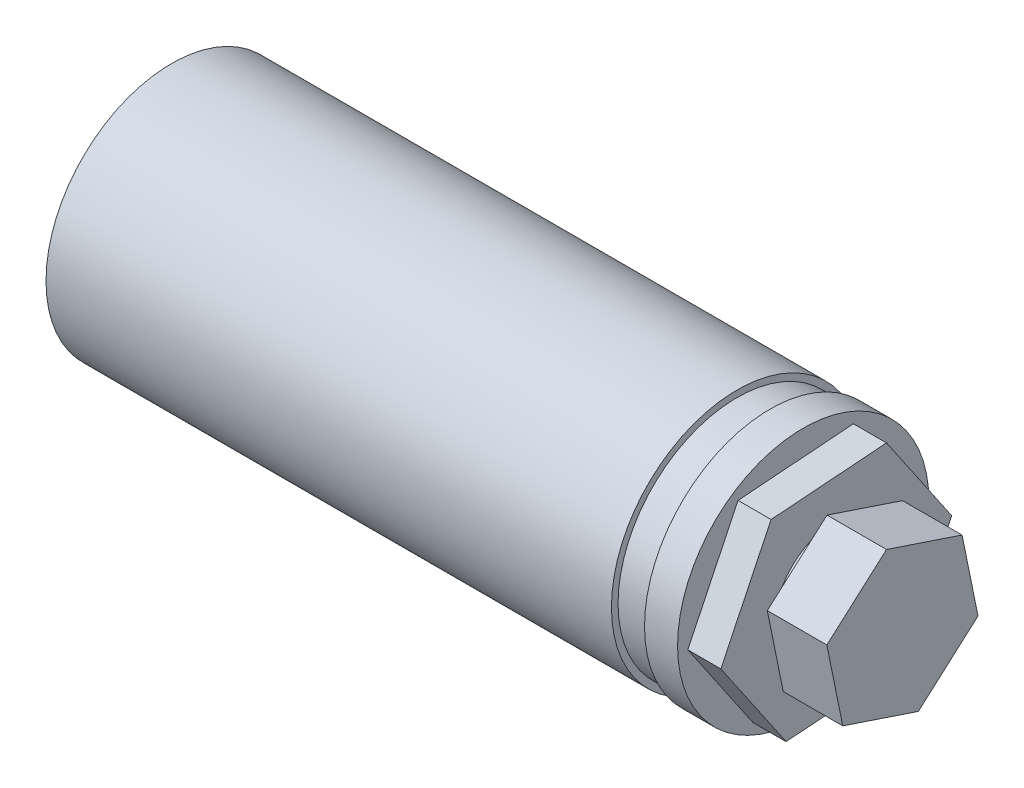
ISO-10303-21;
HEADER;
FILE_DESCRIPTION(('STEP AP214'),'2;1');
FILE_NAME('part.step','',(''),(''),'','','');
FILE_SCHEMA(('AUTOMOTIVE_DESIGN { 1 0 10303 214 1 1 1 1 }'));
ENDSEC;
DATA;
#1=APPLICATION_CONTEXT('core data for automotive mechanical design processes');
#2=APPLICATION_PROTOCOL_DEFINITION('international standard','automotive_design',2000,#1);
#3=PRODUCT_CONTEXT('',#1,'mechanical');
#4=PRODUCT('Part','Part','',(#3));
#5=PRODUCT_RELATED_PRODUCT_CATEGORY('part','',(#4));
#6=PRODUCT_DEFINITION_FORMATION('','',#4);
#7=PRODUCT_DEFINITION_CONTEXT('part definition',#1,'design');
#8=PRODUCT_DEFINITION('design','',#6,#7);
#9=PRODUCT_DEFINITION_SHAPE('','',#8);
#10=(LENGTH_UNIT() NAMED_UNIT(*) SI_UNIT(.MILLI.,.METRE.));
#11=(NAMED_UNIT(*) PLANE_ANGLE_UNIT() SI_UNIT($,.RADIAN.));
#12=(NAMED_UNIT(*) SI_UNIT($,.STERADIAN.) SOLID_ANGLE_UNIT());
#13=UNCERTAINTY_MEASURE_WITH_UNIT(LENGTH_MEASURE(1.E-05),#10,'distance_accuracy_value','');
#14=(GEOMETRIC_REPRESENTATION_CONTEXT(3) GLOBAL_UNCERTAINTY_ASSIGNED_CONTEXT((#13)) GLOBAL_UNIT_ASSIGNED_CONTEXT((#10,
#11,#12)) REPRESENTATION_CONTEXT('',''));
#15=CARTESIAN_POINT('',(0.,0.,0.));
#16=DIRECTION('',(0.,0.,1.));
#17=DIRECTION('',(1.,0.,0.));
#18=AXIS2_PLACEMENT_3D('',#15,#16,#17);
#19=CARTESIAN_POINT('',(95.5,19.,0.));
#20=DIRECTION('',(-1.,0.,0.));
#21=DIRECTION('',(0.,0.,1.));
#22=AXIS2_PLACEMENT_3D('',#19,#20,#21);
#23=PLANE('',#22);
#24=CARTESIAN_POINT('',(95.5,0.,0.));
#25=DIRECTION('',(-1.,0.,0.));
#26=DIRECTION('',(0.,0.,1.));
#27=AXIS2_PLACEMENT_3D('',#24,#25,#26);
#28=CIRCLE('',#27,19.);
#29=CARTESIAN_POINT('',(95.5,0.,19.));
#30=VERTEX_POINT('',#29);
#31=EDGE_CURVE('E198',#30,#30,#28,.T.);
#32=ORIENTED_EDGE('',*,*,#31,.F.);
#33=EDGE_LOOP('',(#32));
#34=FACE_BOUND('',#33,.T.);
#35=DIRECTION('',(0.,-0.0747918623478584,0.997199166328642));
#36=VECTOR('',#35,1.);
#37=CARTESIAN_POINT('',(95.5,15.767425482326,-7.59198878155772));
#38=LINE('',#37,#36);
#39=CARTESIAN_POINT('',(95.5,15.767425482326,-7.59198878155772));
#40=VERTEX_POINT('',#39);
#41=CARTESIAN_POINT('',(95.5,14.4585678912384,9.85899662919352));
#42=VERTEX_POINT('',#41);
#43=EDGE_CURVE('E49',#40,#42,#38,.T.);
#44=ORIENTED_EDGE('',*,*,#43,.F.);
#45=DIRECTION('',(0.,0.826203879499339,0.563371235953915));
#46=VECTOR('',#45,1.);
#47=CARTESIAN_POINT('',(95.5,1.30885759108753,-17.4509854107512));
#48=LINE('',#47,#46);
#49=CARTESIAN_POINT('',(95.5,1.30885759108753,-17.4509854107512));
#50=VERTEX_POINT('',#49);
#51=EDGE_CURVE('E53',#50,#40,#48,.T.);
#52=ORIENTED_EDGE('',*,*,#51,.F.);
#53=DIRECTION('',(0.,0.900995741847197,-0.433827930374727));
#54=VECTOR('',#53,1.);
#55=CARTESIAN_POINT('',(95.5,-14.4585678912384,-9.85899662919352));
#56=LINE('',#55,#54);
#57=CARTESIAN_POINT('',(95.5,-14.4585678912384,-9.85899662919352));
#58=VERTEX_POINT('',#57);
#59=EDGE_CURVE('E178',#58,#50,#56,.T.);
#60=ORIENTED_EDGE('',*,*,#59,.F.);
#61=DIRECTION('',(0.,0.0747918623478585,-0.997199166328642));
#62=VECTOR('',#61,1.);
#63=CARTESIAN_POINT('',(95.5,-15.767425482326,7.59198878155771));
#64=LINE('',#63,#62);
#65=CARTESIAN_POINT('',(95.5,-15.767425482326,7.59198878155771));
#66=VERTEX_POINT('',#65);
#67=EDGE_CURVE('E175',#66,#58,#64,.T.);
#68=ORIENTED_EDGE('',*,*,#67,.F.);
#69=DIRECTION('',(0.,-0.826203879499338,-0.563371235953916));
#70=VECTOR('',#69,1.);
#71=CARTESIAN_POINT('',(95.5,-1.30885759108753,17.4509854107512));
#72=LINE('',#71,#70);
#73=CARTESIAN_POINT('',(95.5,-1.30885759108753,17.4509854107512));
#74=VERTEX_POINT('',#73);
#75=EDGE_CURVE('E172',#74,#66,#72,.T.);
#76=ORIENTED_EDGE('',*,*,#75,.F.);
#77=DIRECTION('',(0.,-0.900995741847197,0.433827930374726));
#78=VECTOR('',#77,1.);
#79=CARTESIAN_POINT('',(95.5,14.4585678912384,9.85899662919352));
#80=LINE('',#79,#78);
#81=EDGE_CURVE('E169',#42,#74,#80,.T.);
#82=ORIENTED_EDGE('',*,*,#81,.F.);
#83=EDGE_LOOP('',(#44,#52,#60,#68,#76,#82));
#84=FACE_BOUND('',#83,.T.);
#85=ADVANCED_FACE('F33',(#34,#84),#23,.F.);
#86=CARTESIAN_POINT('',(0.,0.,0.));
#87=DIRECTION('',(1.,0.,0.));
#88=DIRECTION('',(0.,0.,-1.));
#89=AXIS2_PLACEMENT_3D('',#86,#87,#88);
#90=PLANE('',#89);
#91=CARTESIAN_POINT('',(0.,0.,0.));
#92=DIRECTION('',(-1.,0.,0.));
#93=DIRECTION('',(0.,0.,1.));
#94=AXIS2_PLACEMENT_3D('',#91,#92,#93);
#95=CIRCLE('',#94,19.);
#96=CARTESIAN_POINT('',(0.,0.,19.));
#97=VERTEX_POINT('',#96);
#98=EDGE_CURVE('E37',#97,#97,#95,.T.);
#99=ORIENTED_EDGE('',*,*,#98,.T.);
#100=EDGE_LOOP('',(#99));
#101=FACE_BOUND('',#100,.T.);
#102=ADVANCED_FACE('F35',(#101),#90,.F.);
#103=CARTESIAN_POINT('',(0.,0.,0.));
#104=DIRECTION('',(-1.,0.,0.));
#105=DIRECTION('',(0.,0.,1.));
#106=AXIS2_PLACEMENT_3D('',#103,#104,#105);
#107=CYLINDRICAL_SURFACE('',#106,19.);
#108=ORIENTED_EDGE('',*,*,#98,.F.);
#109=EDGE_LOOP('',(#108));
#110=FACE_BOUND('',#109,.T.);
#111=CARTESIAN_POINT('',(85.5,0.,0.));
#112=DIRECTION('',(-1.,0.,0.));
#113=DIRECTION('',(0.,0.,1.));
#114=AXIS2_PLACEMENT_3D('',#111,#112,#113);
#115=CIRCLE('',#114,19.);
#116=CARTESIAN_POINT('',(85.5,0.,19.));
#117=VERTEX_POINT('',#116);
#118=EDGE_CURVE('E209',#117,#117,#115,.T.);
#119=ORIENTED_EDGE('',*,*,#118,.T.);
#120=EDGE_LOOP('',(#119));
#121=FACE_BOUND('',#120,.T.);
#122=ADVANCED_FACE('F217',(#110,#121),#107,.T.);
#123=CARTESIAN_POINT('',(85.5,19.,0.));
#124=DIRECTION('',(-1.,0.,0.));
#125=DIRECTION('',(0.,0.,1.));
#126=AXIS2_PLACEMENT_3D('',#123,#124,#125);
#127=PLANE('',#126);
#128=ORIENTED_EDGE('',*,*,#118,.F.);
#129=EDGE_LOOP('',(#128));
#130=FACE_BOUND('',#129,.T.);
#131=CARTESIAN_POINT('',(85.5,0.,0.));
#132=DIRECTION('',(-1.,0.,0.));
#133=DIRECTION('',(0.,0.,1.));
#134=AXIS2_PLACEMENT_3D('',#131,#132,#133);
#135=CIRCLE('',#134,18.);
#136=CARTESIAN_POINT('',(85.5,0.,18.));
#137=VERTEX_POINT('',#136);
#138=EDGE_CURVE('E207',#137,#137,#135,.T.);
#139=ORIENTED_EDGE('',*,*,#138,.T.);
#140=EDGE_LOOP('',(#139));
#141=FACE_BOUND('',#140,.T.);
#142=ADVANCED_FACE('F219',(#130,#141),#127,.F.);
#143=CARTESIAN_POINT('',(0.,0.,0.));
#144=DIRECTION('',(-1.,0.,0.));
#145=DIRECTION('',(0.,0.,1.));
#146=AXIS2_PLACEMENT_3D('',#143,#144,#145);
#147=CYLINDRICAL_SURFACE('',#146,18.);
#148=ORIENTED_EDGE('',*,*,#138,.F.);
#149=EDGE_LOOP('',(#148));
#150=FACE_BOUND('',#149,.T.);
#151=CARTESIAN_POINT('',(90.5,0.,0.));
#152=DIRECTION('',(-1.,0.,0.));
#153=DIRECTION('',(0.,0.,1.));
#154=AXIS2_PLACEMENT_3D('',#151,#152,#153);
#155=CIRCLE('',#154,18.);
#156=CARTESIAN_POINT('',(90.5,0.,18.));
#157=VERTEX_POINT('',#156);
#158=EDGE_CURVE('E204',#157,#157,#155,.T.);
#159=ORIENTED_EDGE('',*,*,#158,.T.);
#160=EDGE_LOOP('',(#159));
#161=FACE_BOUND('',#160,.T.);
#162=ADVANCED_FACE('F224',(#150,#161),#147,.T.);
#163=CARTESIAN_POINT('',(90.5,18.,0.));
#164=DIRECTION('',(1.,0.,0.));
#165=DIRECTION('',(0.,0.,-1.));
#166=AXIS2_PLACEMENT_3D('',#163,#164,#165);
#167=PLANE('',#166);
#168=ORIENTED_EDGE('',*,*,#158,.F.);
#169=EDGE_LOOP('',(#168));
#170=FACE_BOUND('',#169,.T.);
#171=CARTESIAN_POINT('',(90.5,0.,0.));
#172=DIRECTION('',(-1.,0.,0.));
#173=DIRECTION('',(0.,0.,1.));
#174=AXIS2_PLACEMENT_3D('',#171,#172,#173);
#175=CIRCLE('',#174,19.);
#176=CARTESIAN_POINT('',(90.5,0.,19.));
#177=VERTEX_POINT('',#176);
#178=EDGE_CURVE('E201',#177,#177,#175,.T.);
#179=ORIENTED_EDGE('',*,*,#178,.T.);
#180=EDGE_LOOP('',(#179));
#181=FACE_BOUND('',#180,.T.);
#182=ADVANCED_FACE('F240',(#170,#181),#167,.F.);
#183=CARTESIAN_POINT('',(0.,0.,0.));
#184=DIRECTION('',(-1.,0.,0.));
#185=DIRECTION('',(0.,0.,1.));
#186=AXIS2_PLACEMENT_3D('',#183,#184,#185);
#187=CYLINDRICAL_SURFACE('',#186,19.);
#188=ORIENTED_EDGE('',*,*,#178,.F.);
#189=EDGE_LOOP('',(#188));
#190=FACE_BOUND('',#189,.T.);
#191=ORIENTED_EDGE('',*,*,#31,.T.);
#192=EDGE_LOOP('',(#191));
#193=FACE_BOUND('',#192,.T.);
#194=ADVANCED_FACE('F237',(#190,#193),#187,.T.);
#195=CARTESIAN_POINT('',(100.5,15.767425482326,-7.59198878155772));
#196=DIRECTION('',(0.,-0.997199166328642,-0.0747918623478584));
#197=DIRECTION('',(0.,0.0747918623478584,-0.997199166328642));
#198=AXIS2_PLACEMENT_3D('',#195,#196,#197);
#199=PLANE('',#198);
#200=ORIENTED_EDGE('',*,*,#43,.T.);
#201=DIRECTION('',(-1.,0.,0.));
#202=VECTOR('',#201,1.);
#203=CARTESIAN_POINT('',(100.5,14.4585678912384,9.85899662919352));
#204=LINE('',#203,#202);
#205=CARTESIAN_POINT('',(100.5,14.4585678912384,9.85899662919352));
#206=VERTEX_POINT('',#205);
#207=EDGE_CURVE('E195',#206,#42,#204,.T.);
#208=ORIENTED_EDGE('',*,*,#207,.F.);
#209=DIRECTION('',(0.,-0.0747918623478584,0.997199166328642));
#210=VECTOR('',#209,1.);
#211=CARTESIAN_POINT('',(100.5,15.767425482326,-7.59198878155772));
#212=LINE('',#211,#210);
#213=CARTESIAN_POINT('',(100.5,15.767425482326,-7.59198878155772));
#214=VERTEX_POINT('',#213);
#215=EDGE_CURVE('E154',#214,#206,#212,.T.);
#216=ORIENTED_EDGE('',*,*,#215,.F.);
#217=DIRECTION('',(-1.,0.,0.));
#218=VECTOR('',#217,1.);
#219=CARTESIAN_POINT('',(100.5,15.767425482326,-7.59198878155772));
#220=LINE('',#219,#218);
#221=EDGE_CURVE('E167',#214,#40,#220,.T.);
#222=ORIENTED_EDGE('',*,*,#221,.T.);
#223=EDGE_LOOP('',(#200,#208,#216,#222));
#224=FACE_BOUND('',#223,.T.);
#225=ADVANCED_FACE('F235',(#224),#199,.F.);
#226=CARTESIAN_POINT('',(100.5,14.4585678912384,9.85899662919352));
#227=DIRECTION('',(0.,-0.433827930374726,-0.900995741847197));
#228=DIRECTION('',(0.,0.900995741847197,-0.433827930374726));
#229=AXIS2_PLACEMENT_3D('',#226,#227,#228);
#230=PLANE('',#229);
#231=ORIENTED_EDGE('',*,*,#81,.T.);
#232=DIRECTION('',(-1.,0.,0.));
#233=VECTOR('',#232,1.);
#234=CARTESIAN_POINT('',(100.5,-1.30885759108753,17.4509854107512));
#235=LINE('',#234,#233);
#236=CARTESIAN_POINT('',(100.5,-1.30885759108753,17.4509854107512));
#237=VERTEX_POINT('',#236);
#238=EDGE_CURVE('E192',#237,#74,#235,.T.);
#239=ORIENTED_EDGE('',*,*,#238,.F.);
#240=DIRECTION('',(0.,-0.900995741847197,0.433827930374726));
#241=VECTOR('',#240,1.);
#242=CARTESIAN_POINT('',(100.5,14.4585678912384,9.85899662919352));
#243=LINE('',#242,#241);
#244=EDGE_CURVE('E157',#206,#237,#243,.T.);
#245=ORIENTED_EDGE('',*,*,#244,.F.);
#246=ORIENTED_EDGE('',*,*,#207,.T.);
#247=EDGE_LOOP('',(#231,#239,#245,#246));
#248=FACE_BOUND('',#247,.T.);
#249=ADVANCED_FACE('F272',(#248),#230,.F.);
#250=CARTESIAN_POINT('',(100.5,-1.30885759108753,17.4509854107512));
#251=DIRECTION('',(0.,0.563371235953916,-0.826203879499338));
#252=DIRECTION('',(0.,0.826203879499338,0.563371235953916));
#253=AXIS2_PLACEMENT_3D('',#250,#251,#252);
#254=PLANE('',#253);
#255=ORIENTED_EDGE('',*,*,#75,.T.);
#256=DIRECTION('',(-1.,0.,0.));
#257=VECTOR('',#256,1.);
#258=CARTESIAN_POINT('',(100.5,-15.767425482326,7.59198878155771));
#259=LINE('',#258,#257);
#260=CARTESIAN_POINT('',(100.5,-15.767425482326,7.59198878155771));
#261=VERTEX_POINT('',#260);
#262=EDGE_CURVE('E189',#261,#66,#259,.T.);
#263=ORIENTED_EDGE('',*,*,#262,.F.);
#264=DIRECTION('',(0.,-0.826203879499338,-0.563371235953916));
#265=VECTOR('',#264,1.);
#266=CARTESIAN_POINT('',(100.5,-1.30885759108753,17.4509854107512));
#267=LINE('',#266,#265);
#268=EDGE_CURVE('E159',#237,#261,#267,.T.);
#269=ORIENTED_EDGE('',*,*,#268,.F.);
#270=ORIENTED_EDGE('',*,*,#238,.T.);
#271=EDGE_LOOP('',(#255,#263,#269,#270));
#272=FACE_BOUND('',#271,.T.);
#273=ADVANCED_FACE('F279',(#272),#254,.F.);
#274=CARTESIAN_POINT('',(100.5,-15.767425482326,7.59198878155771));
#275=DIRECTION('',(0.,0.997199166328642,0.0747918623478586));
#276=DIRECTION('',(0.,-0.0747918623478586,0.997199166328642));
#277=AXIS2_PLACEMENT_3D('',#274,#275,#276);
#278=PLANE('',#277);
#279=ORIENTED_EDGE('',*,*,#67,.T.);
#280=DIRECTION('',(-1.,0.,0.));
#281=VECTOR('',#280,1.);
#282=CARTESIAN_POINT('',(100.5,-14.4585678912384,-9.85899662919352));
#283=LINE('',#282,#281);
#284=CARTESIAN_POINT('',(100.5,-14.4585678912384,-9.85899662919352));
#285=VERTEX_POINT('',#284);
#286=EDGE_CURVE('E186',#285,#58,#283,.T.);
#287=ORIENTED_EDGE('',*,*,#286,.F.);
#288=DIRECTION('',(0.,0.0747918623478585,-0.997199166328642));
#289=VECTOR('',#288,1.);
#290=CARTESIAN_POINT('',(100.5,-15.767425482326,7.59198878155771));
#291=LINE('',#290,#289);
#292=EDGE_CURVE('E161',#261,#285,#291,.T.);
#293=ORIENTED_EDGE('',*,*,#292,.F.);
#294=ORIENTED_EDGE('',*,*,#262,.T.);
#295=EDGE_LOOP('',(#279,#287,#293,#294));
#296=FACE_BOUND('',#295,.T.);
#297=ADVANCED_FACE('F286',(#296),#278,.F.);
#298=CARTESIAN_POINT('',(100.5,-14.4585678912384,-9.85899662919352));
#299=DIRECTION('',(0.,0.433827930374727,0.900995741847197));
#300=DIRECTION('',(0.,-0.900995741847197,0.433827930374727));
#301=AXIS2_PLACEMENT_3D('',#298,#299,#300);
#302=PLANE('',#301);
#303=ORIENTED_EDGE('',*,*,#59,.T.);
#304=DIRECTION('',(-1.,0.,0.));
#305=VECTOR('',#304,1.);
#306=CARTESIAN_POINT('',(100.5,1.30885759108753,-17.4509854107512));
#307=LINE('',#306,#305);
#308=CARTESIAN_POINT('',(100.5,1.30885759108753,-17.4509854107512));
#309=VERTEX_POINT('',#308);
#310=EDGE_CURVE('E183',#309,#50,#307,.T.);
#311=ORIENTED_EDGE('',*,*,#310,.F.);
#312=DIRECTION('',(0.,0.900995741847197,-0.433827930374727));
#313=VECTOR('',#312,1.);
#314=CARTESIAN_POINT('',(100.5,-14.4585678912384,-9.85899662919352));
#315=LINE('',#314,#313);
#316=EDGE_CURVE('E163',#285,#309,#315,.T.);
#317=ORIENTED_EDGE('',*,*,#316,.F.);
#318=ORIENTED_EDGE('',*,*,#286,.T.);
#319=EDGE_LOOP('',(#303,#311,#317,#318));
#320=FACE_BOUND('',#319,.T.);
#321=ADVANCED_FACE('F294',(#320),#302,.F.);
#322=CARTESIAN_POINT('',(100.5,1.30885759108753,-17.4509854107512));
#323=DIRECTION('',(0.,-0.563371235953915,0.826203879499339));
#324=DIRECTION('',(0.,-0.826203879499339,-0.563371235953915));
#325=AXIS2_PLACEMENT_3D('',#322,#323,#324);
#326=PLANE('',#325);
#327=ORIENTED_EDGE('',*,*,#51,.T.);
#328=ORIENTED_EDGE('',*,*,#221,.F.);
#329=DIRECTION('',(0.,0.826203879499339,0.563371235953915));
#330=VECTOR('',#329,1.);
#331=CARTESIAN_POINT('',(100.5,1.30885759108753,-17.4509854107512));
#332=LINE('',#331,#330);
#333=EDGE_CURVE('E165',#309,#214,#332,.T.);
#334=ORIENTED_EDGE('',*,*,#333,.F.);
#335=ORIENTED_EDGE('',*,*,#310,.T.);
#336=EDGE_LOOP('',(#327,#328,#334,#335));
#337=FACE_BOUND('',#336,.T.);
#338=ADVANCED_FACE('F302',(#337),#326,.F.);
#339=CARTESIAN_POINT('',(100.5,0.,0.));
#340=DIRECTION('',(1.,0.,0.));
#341=DIRECTION('',(0.,0.,-1.));
#342=AXIS2_PLACEMENT_3D('',#339,#340,#341);
#343=PLANE('',#342);
#344=CARTESIAN_POINT('',(100.5,0.,0.));
#345=DIRECTION('',(1.,0.,0.));
#346=DIRECTION('',(0.,0.,-1.));
#347=AXIS2_PLACEMENT_3D('',#344,#345,#346);
#348=CIRCLE('',#347,9.5);
#349=CARTESIAN_POINT('',(100.5,0.,-9.5));
#350=VERTEX_POINT('',#349);
#351=EDGE_CURVE('E11',#350,#350,#348,.T.);
#352=ORIENTED_EDGE('',*,*,#351,.F.);
#353=EDGE_LOOP('',(#352));
#354=FACE_BOUND('',#353,.T.);
#355=ORIENTED_EDGE('',*,*,#215,.T.);
#356=ORIENTED_EDGE('',*,*,#244,.T.);
#357=ORIENTED_EDGE('',*,*,#268,.T.);
#358=ORIENTED_EDGE('',*,*,#292,.T.);
#359=ORIENTED_EDGE('',*,*,#316,.T.);
#360=ORIENTED_EDGE('',*,*,#333,.T.);
#361=EDGE_LOOP('',(#355,#356,#357,#358,#359,#360));
#362=FACE_BOUND('',#361,.T.);
#363=ADVANCED_FACE('F310',(#354,#362),#343,.T.);
#364=CARTESIAN_POINT('',(101.5,0.,0.));
#365=DIRECTION('',(-1.,0.,0.));
#366=DIRECTION('',(0.,0.,1.));
#367=AXIS2_PLACEMENT_3D('',#364,#365,#366);
#368=CYLINDRICAL_SURFACE('',#367,9.5);
#369=CARTESIAN_POINT('',(101.5,0.,0.));
#370=DIRECTION('',(1.,0.,0.));
#371=DIRECTION('',(0.,0.,-1.));
#372=AXIS2_PLACEMENT_3D('',#369,#370,#371);
#373=CIRCLE('',#372,9.5);
#374=CARTESIAN_POINT('',(101.5,0.,-9.5));
#375=VERTEX_POINT('',#374);
#376=EDGE_CURVE('E146',#375,#375,#373,.T.);
#377=ORIENTED_EDGE('',*,*,#376,.F.);
#378=EDGE_LOOP('',(#377));
#379=FACE_BOUND('',#378,.T.);
#380=ORIENTED_EDGE('',*,*,#351,.T.);
#381=EDGE_LOOP('',(#380));
#382=FACE_BOUND('',#381,.T.);
#383=ADVANCED_FACE('F318',(#379,#382),#368,.T.);
#384=CARTESIAN_POINT('',(110.5,7.98812241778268,-9.02177367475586));
#385=DIRECTION('',(0.,-0.948448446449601,0.316931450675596));
#386=DIRECTION('',(0.,-0.316931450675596,-0.948448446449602));
#387=AXIS2_PLACEMENT_3D('',#384,#385,#386);
#388=PLANE('',#387);
#389=DIRECTION('',(0.,0.316931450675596,0.948448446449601));
#390=VECTOR('',#389,1.);
#391=CARTESIAN_POINT('',(101.5,7.98812241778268,-9.02177367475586));
#392=LINE('',#391,#390);
#393=CARTESIAN_POINT('',(101.5,7.98812241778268,-9.02177367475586));
#394=VERTEX_POINT('',#393);
#395=CARTESIAN_POINT('',(101.5,11.8071463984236,2.40703010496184));
#396=VERTEX_POINT('',#395);
#397=EDGE_CURVE('E145',#394,#396,#392,.T.);
#398=ORIENTED_EDGE('',*,*,#397,.T.);
#399=DIRECTION('',(-1.,0.,0.));
#400=VECTOR('',#399,1.);
#401=CARTESIAN_POINT('',(110.5,11.8071463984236,2.40703010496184));
#402=LINE('',#401,#400);
#403=CARTESIAN_POINT('',(110.5,11.8071463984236,2.40703010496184));
#404=VERTEX_POINT('',#403);
#405=EDGE_CURVE('E125',#404,#396,#402,.T.);
#406=ORIENTED_EDGE('',*,*,#405,.F.);
#407=DIRECTION('',(0.,0.316931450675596,0.948448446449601));
#408=VECTOR('',#407,1.);
#409=CARTESIAN_POINT('',(110.5,7.98812241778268,-9.02177367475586));
#410=LINE('',#409,#408);
#411=CARTESIAN_POINT('',(110.5,7.98812241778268,-9.02177367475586));
#412=VERTEX_POINT('',#411);
#413=EDGE_CURVE('E132',#412,#404,#410,.T.);
#414=ORIENTED_EDGE('',*,*,#413,.F.);
#415=DIRECTION('',(-1.,0.,0.));
#416=VECTOR('',#415,1.);
#417=CARTESIAN_POINT('',(110.5,7.98812241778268,-9.02177367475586));
#418=LINE('',#417,#416);
#419=EDGE_CURVE('E461',#412,#394,#418,.T.);
#420=ORIENTED_EDGE('',*,*,#419,.T.);
#421=EDGE_LOOP('',(#398,#406,#414,#420));
#422=FACE_BOUND('',#421,.T.);
#423=ADVANCED_FACE('F143',(#422),#388,.F.);
#424=CARTESIAN_POINT('',(110.5,11.8071463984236,2.40703010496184));
#425=DIRECTION('',(0.,-0.748694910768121,-0.662914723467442));
#426=DIRECTION('',(0.,0.662914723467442,-0.748694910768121));
#427=AXIS2_PLACEMENT_3D('',#424,#425,#426);
#428=PLANE('',#427);
#429=DIRECTION('',(0.,-0.662914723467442,0.748694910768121));
#430=VECTOR('',#429,1.);
#431=CARTESIAN_POINT('',(101.5,11.8071463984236,2.40703010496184));
#432=LINE('',#431,#430);
#433=CARTESIAN_POINT('',(101.5,3.81902398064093,11.4288037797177));
#434=VERTEX_POINT('',#433);
#435=EDGE_CURVE('E448',#396,#434,#432,.T.);
#436=ORIENTED_EDGE('',*,*,#435,.T.);
#437=DIRECTION('',(-1.,0.,0.));
#438=VECTOR('',#437,1.);
#439=CARTESIAN_POINT('',(110.5,3.81902398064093,11.4288037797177));
#440=LINE('',#439,#438);
#441=CARTESIAN_POINT('',(110.5,3.81902398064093,11.4288037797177));
#442=VERTEX_POINT('',#441);
#443=EDGE_CURVE('E128',#442,#434,#440,.T.);
#444=ORIENTED_EDGE('',*,*,#443,.F.);
#445=DIRECTION('',(0.,-0.662914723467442,0.748694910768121));
#446=VECTOR('',#445,1.);
#447=CARTESIAN_POINT('',(110.5,11.8071463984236,2.40703010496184));
#448=LINE('',#447,#446);
#449=EDGE_CURVE('E121',#404,#442,#448,.T.);
#450=ORIENTED_EDGE('',*,*,#449,.F.);
#451=ORIENTED_EDGE('',*,*,#405,.T.);
#452=EDGE_LOOP('',(#436,#444,#450,#451));
#453=FACE_BOUND('',#452,.T.);
#454=ADVANCED_FACE('F123',(#453),#428,.F.);
#455=CARTESIAN_POINT('',(110.5,3.81902398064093,11.4288037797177));
#456=DIRECTION('',(0.,0.19975353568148,-0.979846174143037));
#457=DIRECTION('',(0.,0.979846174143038,0.19975353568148));
#458=AXIS2_PLACEMENT_3D('',#455,#456,#457);
#459=PLANE('',#458);
#460=DIRECTION('',(0.,-0.979846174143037,-0.19975353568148));
#461=VECTOR('',#460,1.);
#462=CARTESIAN_POINT('',(101.5,3.81902398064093,11.4288037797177));
#463=LINE('',#462,#461);
#464=CARTESIAN_POINT('',(101.5,-7.98812241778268,9.02177367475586));
#465=VERTEX_POINT('',#464);
#466=EDGE_CURVE('E450',#434,#465,#463,.T.);
#467=ORIENTED_EDGE('',*,*,#466,.T.);
#468=DIRECTION('',(-1.,0.,0.));
#469=VECTOR('',#468,1.);
#470=CARTESIAN_POINT('',(110.5,-7.98812241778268,9.02177367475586));
#471=LINE('',#470,#469);
#472=CARTESIAN_POINT('',(110.5,-7.98812241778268,9.02177367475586));
#473=VERTEX_POINT('',#472);
#474=EDGE_CURVE('E150',#473,#465,#471,.T.);
#475=ORIENTED_EDGE('',*,*,#474,.F.);
#476=DIRECTION('',(0.,-0.979846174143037,-0.19975353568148));
#477=VECTOR('',#476,1.);
#478=CARTESIAN_POINT('',(110.5,3.81902398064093,11.4288037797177));
#479=LINE('',#478,#477);
#480=EDGE_CURVE('E131',#442,#473,#479,.T.);
#481=ORIENTED_EDGE('',*,*,#480,.F.);
#482=ORIENTED_EDGE('',*,*,#443,.T.);
#483=EDGE_LOOP('',(#467,#475,#481,#482));
#484=FACE_BOUND('',#483,.T.);
#485=ADVANCED_FACE('F339',(#484),#459,.F.);
#486=CARTESIAN_POINT('',(110.5,-7.98812241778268,9.02177367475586));
#487=DIRECTION('',(0.,0.948448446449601,-0.316931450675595));
#488=DIRECTION('',(0.,0.316931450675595,0.948448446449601));
#489=AXIS2_PLACEMENT_3D('',#486,#487,#488);
#490=PLANE('',#489);
#491=DIRECTION('',(0.,-0.316931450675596,-0.948448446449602));
#492=VECTOR('',#491,1.);
#493=CARTESIAN_POINT('',(101.5,-7.98812241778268,9.02177367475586));
#494=LINE('',#493,#492);
#495=CARTESIAN_POINT('',(101.5,-11.8071463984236,-2.40703010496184));
#496=VERTEX_POINT('',#495);
#497=EDGE_CURVE('E456',#465,#496,#494,.T.);
#498=ORIENTED_EDGE('',*,*,#497,.T.);
#499=DIRECTION('',(-1.,0.,0.));
#500=VECTOR('',#499,1.);
#501=CARTESIAN_POINT('',(110.5,-11.8071463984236,-2.40703010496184));
#502=LINE('',#501,#500);
#503=CARTESIAN_POINT('',(110.5,-11.8071463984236,-2.40703010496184));
#504=VERTEX_POINT('',#503);
#505=EDGE_CURVE('E466',#504,#496,#502,.T.);
#506=ORIENTED_EDGE('',*,*,#505,.F.);
#507=DIRECTION('',(0.,-0.316931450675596,-0.948448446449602));
#508=VECTOR('',#507,1.);
#509=CARTESIAN_POINT('',(110.5,-7.98812241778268,9.02177367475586));
#510=LINE('',#509,#508);
#511=EDGE_CURVE('E473',#473,#504,#510,.T.);
#512=ORIENTED_EDGE('',*,*,#511,.F.);
#513=ORIENTED_EDGE('',*,*,#474,.T.);
#514=EDGE_LOOP('',(#498,#506,#512,#513));
#515=FACE_BOUND('',#514,.T.);
#516=ADVANCED_FACE('F346',(#515),#490,.F.);
#517=CARTESIAN_POINT('',(110.5,-11.8071463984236,-2.40703010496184));
#518=DIRECTION('',(0.,0.748694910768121,0.662914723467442));
#519=DIRECTION('',(0.,-0.662914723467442,0.748694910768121));
#520=AXIS2_PLACEMENT_3D('',#517,#518,#519);
#521=PLANE('',#520);
#522=DIRECTION('',(0.,0.662914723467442,-0.748694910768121));
#523=VECTOR('',#522,1.);
#524=CARTESIAN_POINT('',(101.5,-11.8071463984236,-2.40703010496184));
#525=LINE('',#524,#523);
#526=CARTESIAN_POINT('',(101.5,-3.81902398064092,-11.4288037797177));
#527=VERTEX_POINT('',#526);
#528=EDGE_CURVE('E458',#496,#527,#525,.T.);
#529=ORIENTED_EDGE('',*,*,#528,.T.);
#530=DIRECTION('',(-1.,0.,0.));
#531=VECTOR('',#530,1.);
#532=CARTESIAN_POINT('',(110.5,-3.81902398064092,-11.4288037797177));
#533=LINE('',#532,#531);
#534=CARTESIAN_POINT('',(110.5,-3.81902398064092,-11.4288037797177));
#535=VERTEX_POINT('',#534);
#536=EDGE_CURVE('E463',#535,#527,#533,.T.);
#537=ORIENTED_EDGE('',*,*,#536,.F.);
#538=DIRECTION('',(0.,0.662914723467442,-0.748694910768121));
#539=VECTOR('',#538,1.);
#540=CARTESIAN_POINT('',(110.5,-11.8071463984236,-2.40703010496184));
#541=LINE('',#540,#539);
#542=EDGE_CURVE('E476',#504,#535,#541,.T.);
#543=ORIENTED_EDGE('',*,*,#542,.F.);
#544=ORIENTED_EDGE('',*,*,#505,.T.);
#545=EDGE_LOOP('',(#529,#537,#543,#544));
#546=FACE_BOUND('',#545,.T.);
#547=ADVANCED_FACE('F354',(#546),#521,.F.);
#548=CARTESIAN_POINT('',(110.5,-3.81902398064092,-11.4288037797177));
#549=DIRECTION('',(0.,-0.19975353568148,0.979846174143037));
#550=DIRECTION('',(0.,-0.979846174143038,-0.19975353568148));
#551=AXIS2_PLACEMENT_3D('',#548,#549,#550);
#552=PLANE('',#551);
#553=DIRECTION('',(0.,0.979846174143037,0.19975353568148));
#554=VECTOR('',#553,1.);
#555=CARTESIAN_POINT('',(101.5,-3.81902398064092,-11.4288037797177));
#556=LINE('',#555,#554);
#557=EDGE_CURVE('E141',#527,#394,#556,.T.);
#558=ORIENTED_EDGE('',*,*,#557,.T.);
#559=ORIENTED_EDGE('',*,*,#419,.F.);
#560=DIRECTION('',(0.,0.979846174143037,0.19975353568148));
#561=VECTOR('',#560,1.);
#562=CARTESIAN_POINT('',(110.5,-3.81902398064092,-11.4288037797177));
#563=LINE('',#562,#561);
#564=EDGE_CURVE('E137',#535,#412,#563,.T.);
#565=ORIENTED_EDGE('',*,*,#564,.F.);
#566=ORIENTED_EDGE('',*,*,#536,.T.);
#567=EDGE_LOOP('',(#558,#559,#565,#566));
#568=FACE_BOUND('',#567,.T.);
#569=ADVANCED_FACE('F362',(#568),#552,.F.);
#570=CARTESIAN_POINT('',(110.5,0.,0.));
#571=DIRECTION('',(1.,0.,0.));
#572=DIRECTION('',(0.,0.,-1.));
#573=AXIS2_PLACEMENT_3D('',#570,#571,#572);
#574=PLANE('',#573);
#575=ORIENTED_EDGE('',*,*,#413,.T.);
#576=ORIENTED_EDGE('',*,*,#449,.T.);
#577=ORIENTED_EDGE('',*,*,#480,.T.);
#578=ORIENTED_EDGE('',*,*,#511,.T.);
#579=ORIENTED_EDGE('',*,*,#542,.T.);
#580=ORIENTED_EDGE('',*,*,#564,.T.);
#581=EDGE_LOOP('',(#575,#576,#577,#578,#579,#580));
#582=FACE_BOUND('',#581,.T.);
#583=ADVANCED_FACE('F135',(#582),#574,.T.);
#584=CARTESIAN_POINT('',(101.5,0.,0.));
#585=DIRECTION('',(1.,0.,0.));
#586=DIRECTION('',(0.,0.,-1.));
#587=AXIS2_PLACEMENT_3D('',#584,#585,#586);
#588=PLANE('',#587);
#589=ORIENTED_EDGE('',*,*,#376,.T.);
#590=EDGE_LOOP('',(#589));
#591=FACE_BOUND('',#590,.T.);
#592=ORIENTED_EDGE('',*,*,#397,.F.);
#593=ORIENTED_EDGE('',*,*,#557,.F.);
#594=ORIENTED_EDGE('',*,*,#528,.F.);
#595=ORIENTED_EDGE('',*,*,#497,.F.);
#596=ORIENTED_EDGE('',*,*,#466,.F.);
#597=ORIENTED_EDGE('',*,*,#435,.F.);
#598=EDGE_LOOP('',(#592,#593,#594,#595,#596,#597));
#599=FACE_BOUND('',#598,.T.);
#600=ADVANCED_FACE('F377',(#591,#599),#588,.F.);
#601=CLOSED_SHELL('',(#85,#102,#122,#142,#162,#182,#194,#225,#249,#273,#297,#321,#338,#363,#383,
#423,#454,#485,#516,#547,#569,#583,#600));
#602=MANIFOLD_SOLID_BREP('B2',#601);
#603=ADVANCED_BREP_SHAPE_REPRESENTATION('',(#18,#602),#14);
#604=SHAPE_DEFINITION_REPRESENTATION(#9,#603);
ENDSEC;
END-ISO-10303-21;
